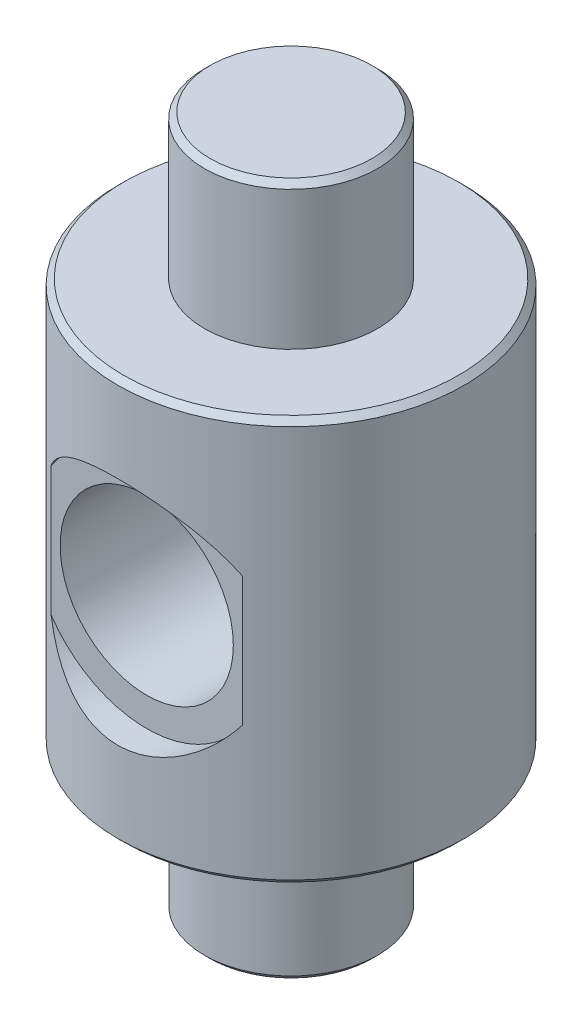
from build123d import *

# Parameters (mm, degrees)
SKETCH4_R          = 2
CUT_EXTRUDE1_DEPTH = 0.5
SKETCH5_R          = 1.5
CUT_EXTRUDE2_DEPTH = 14.536986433
CHAMFER1_SIZE      = 0.1


with BuildPart() as part:
    # Sketch1 → Revolve2 (revolve)
    with BuildSketch(Plane.XY, mode=Mode.PRIVATE) as revolve2_sk:
        Polygon((0, 12), (-1.5, 12), (-1.5, 9.5), (-3, 9.5), (-3, 2.5), (-1.5, 2.5), (-1.5, 0), (0, 0), align=None)
    revolve(revolve2_sk.sketch.rotate(Axis((0, 0, 0), (0, -1, 0)), 270), axis=Axis((0, 0, 0), (0, -1, 0)))

    # Sketch4 → Cut-Extrude1 (cut)
    with BuildSketch(Plane.XY.offset(3)):
        with Locations((0, 6)):
            Circle(SKETCH4_R)
    cut_extrude1 = extrude(amount=-CUT_EXTRUDE1_DEPTH, mode=Mode.SUBTRACT)

    # Mirror1: Cut-Extrude1 across plane
    add(cut_extrude1.mirror(Plane.XY), mode=Mode.SUBTRACT)

    # Sketch5 → Cut-Extrude2 (cut, through all)
    with BuildSketch(Plane.XY.offset(2.5)):
        with Locations((0, 6)):
            Circle(SKETCH5_R)
    extrude(amount=-CUT_EXTRUDE2_DEPTH, mode=Mode.SUBTRACT)

    # Chamfer1
    chamfer1_edges = [part.edges().sort_by_distance(p)[0] for p in [
        (0, 0, -1.5),
        (0, 2.5, -3),
        (0, 9.5, -3),
        (0, 12, -1.5),
    ]]
    chamfer(chamfer1_edges, length=CHAMFER1_SIZE)


solid = part.part
